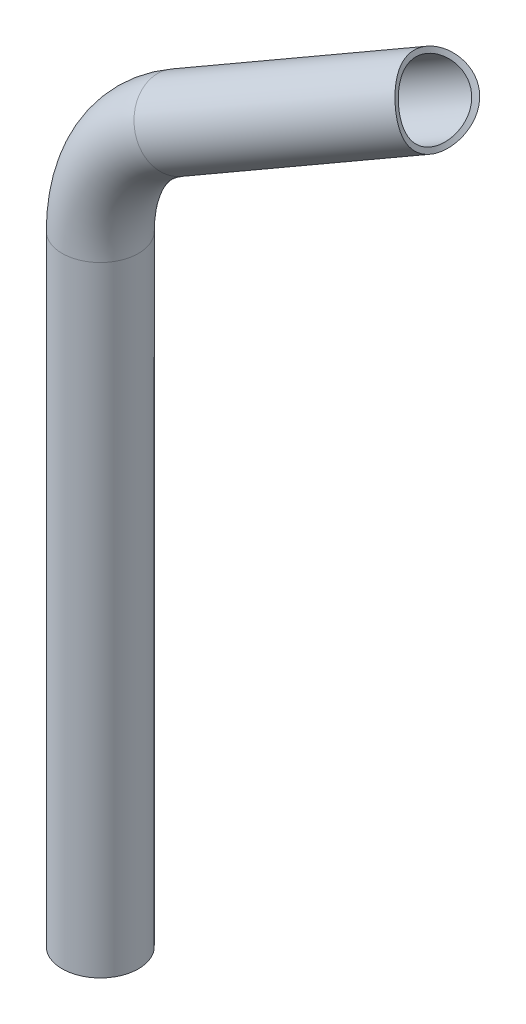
ISO-10303-21;
HEADER;
FILE_DESCRIPTION(('STEP AP214'),'2;1');
FILE_NAME('part.step','',(''),(''),'','','');
FILE_SCHEMA(('AUTOMOTIVE_DESIGN { 1 0 10303 214 1 1 1 1 }'));
ENDSEC;
DATA;
#1=APPLICATION_CONTEXT('core data for automotive mechanical design processes');
#2=APPLICATION_PROTOCOL_DEFINITION('international standard','automotive_design',2000,#1);
#3=PRODUCT_CONTEXT('',#1,'mechanical');
#4=PRODUCT('Part','Part','',(#3));
#5=PRODUCT_RELATED_PRODUCT_CATEGORY('part','',(#4));
#6=PRODUCT_DEFINITION_FORMATION('','',#4);
#7=PRODUCT_DEFINITION_CONTEXT('part definition',#1,'design');
#8=PRODUCT_DEFINITION('design','',#6,#7);
#9=PRODUCT_DEFINITION_SHAPE('','',#8);
#10=(LENGTH_UNIT() NAMED_UNIT(*) SI_UNIT(.MILLI.,.METRE.));
#11=(NAMED_UNIT(*) PLANE_ANGLE_UNIT() SI_UNIT($,.RADIAN.));
#12=(NAMED_UNIT(*) SI_UNIT($,.STERADIAN.) SOLID_ANGLE_UNIT());
#13=UNCERTAINTY_MEASURE_WITH_UNIT(LENGTH_MEASURE(1.E-05),#10,'distance_accuracy_value','');
#14=(GEOMETRIC_REPRESENTATION_CONTEXT(3) GLOBAL_UNCERTAINTY_ASSIGNED_CONTEXT((#13)) GLOBAL_UNIT_ASSIGNED_CONTEXT((#10,
#11,#12)) REPRESENTATION_CONTEXT('',''));
#15=CARTESIAN_POINT('',(0.,0.,0.));
#16=DIRECTION('',(0.,0.,1.));
#17=DIRECTION('',(1.,0.,0.));
#18=AXIS2_PLACEMENT_3D('',#15,#16,#17);
#19=CARTESIAN_POINT('',(-125.,-72.1687836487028,0.));
#20=DIRECTION('',(0.86602540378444,0.499999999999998,0.));
#21=DIRECTION('',(-0.499999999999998,0.86602540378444,0.));
#22=AXIS2_PLACEMENT_3D('',#19,#20,#21);
#23=CYLINDRICAL_SURFACE('',#22,15.);
#24=CARTESIAN_POINT('',(-32.1343184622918,-1.23224933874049,0.));
#25=CARTESIAN_POINT('',(-32.1747169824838,-1.25557177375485,-0.391519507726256));
#26=CARTESIAN_POINT('',(-32.2030378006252,-1.2896340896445,-0.783623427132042));
#27=CARTESIAN_POINT('',(-32.2345045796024,-1.37884393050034,-1.56657088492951));
#28=CARTESIAN_POINT('',(-32.2376441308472,-1.43399682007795,-1.95741407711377));
#29=CARTESIAN_POINT('',(-32.218062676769,-1.56494458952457,-2.73534371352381));
#30=CARTESIAN_POINT('',(-32.1953182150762,-1.64075814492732,-3.12242642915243));
#31=CARTESIAN_POINT('',(-32.1237109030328,-1.81238845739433,-3.88965809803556));
#32=CARTESIAN_POINT('',(-32.0748498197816,-1.90820386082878,-4.26980751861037));
#33=CARTESIAN_POINT('',(-31.9512495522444,-2.11911780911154,-5.02040304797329));
#34=CARTESIAN_POINT('',(-31.8765117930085,-2.23421529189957,-5.39084968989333));
#35=CARTESIAN_POINT('',(-31.7018506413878,-2.48289195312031,-6.11939821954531));
#36=CARTESIAN_POINT('',(-31.6019268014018,-2.61647145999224,-6.47749988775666));
#37=CARTESIAN_POINT('',(-31.378034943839,-2.90122245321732,-7.17881067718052));
#38=CARTESIAN_POINT('',(-31.2540702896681,-3.05239147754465,-7.5220218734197));
#39=CARTESIAN_POINT('',(-30.9835923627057,-3.37144622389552,-8.19134972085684));
#40=CARTESIAN_POINT('',(-30.8370789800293,-3.53933202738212,-8.51746628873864));
#41=CARTESIAN_POINT('',(-30.5231303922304,-3.89116492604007,-9.15100440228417));
#42=CARTESIAN_POINT('',(-30.3556694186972,-4.07513171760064,-9.45840221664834));
#43=CARTESIAN_POINT('',(-30.0020487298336,-4.45812483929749,-10.0523300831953));
#44=CARTESIAN_POINT('',(-29.8158890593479,-4.65715113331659,-10.3388601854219));
#45=CARTESIAN_POINT('',(-29.4270899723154,-5.06957795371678,-10.8896406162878));
#46=CARTESIAN_POINT('',(-29.2244466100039,-5.28298191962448,-11.153885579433));
#47=CARTESIAN_POINT('',(-28.8051164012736,-5.72350044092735,-11.658765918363));
#48=CARTESIAN_POINT('',(-28.5884285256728,-5.95061600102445,-11.8993995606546));
#49=CARTESIAN_POINT('',(-28.1291141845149,-6.43317335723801,-12.3707326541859));
#50=CARTESIAN_POINT('',(-27.8857167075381,-6.6894970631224,-12.5997793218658));
#51=CARTESIAN_POINT('',(-27.3890053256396,-7.21658481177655,-13.0286528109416));
#52=CARTESIAN_POINT('',(-27.1356910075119,-7.48734945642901,-13.2284784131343));
#53=CARTESIAN_POINT('',(-26.6223345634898,-8.04299659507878,-13.5978680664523));
#54=CARTESIAN_POINT('',(-26.3622902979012,-8.32788360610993,-13.7674223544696));
#55=CARTESIAN_POINT('',(-25.8388364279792,-8.91145409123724,-14.0752052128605));
#56=CARTESIAN_POINT('',(-25.575425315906,-9.21014391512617,-14.2134191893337));
#57=CARTESIAN_POINT('',(-25.038186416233,-9.83321546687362,-14.4623556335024));
#58=CARTESIAN_POINT('',(-24.7643707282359,-10.1581480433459,-14.5717312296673));
#59=CARTESIAN_POINT('',(-24.2213917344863,-10.8215410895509,-14.7541586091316));
#60=CARTESIAN_POINT('',(-23.9522260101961,-11.1599942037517,-14.8272298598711));
#61=CARTESIAN_POINT('',(-23.4228491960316,-11.8494041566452,-14.936107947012));
#62=CARTESIAN_POINT('',(-23.1626332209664,-12.2003539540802,-14.9719354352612));
#63=CARTESIAN_POINT('',(-22.655349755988,-12.9134063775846,-15.0056358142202));
#64=CARTESIAN_POINT('',(-22.4082806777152,-13.2755076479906,-15.0035133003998));
#65=CARTESIAN_POINT('',(-21.9499504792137,-13.9802481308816,-14.9626400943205));
#66=CARTESIAN_POINT('',(-21.7373986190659,-14.3222147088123,-14.9267469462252));
#67=CARTESIAN_POINT('',(-21.3298981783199,-15.0116620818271,-14.8225604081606));
#68=CARTESIAN_POINT('',(-21.1349485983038,-15.3591425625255,-14.754268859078));
#69=CARTESIAN_POINT('',(-20.7651013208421,-16.056884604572,-14.5859644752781));
#70=CARTESIAN_POINT('',(-20.5901953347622,-16.407144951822,-14.4859648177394));
#71=CARTESIAN_POINT('',(-20.2620080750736,-17.1077037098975,-14.2553630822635));
#72=CARTESIAN_POINT('',(-20.1087259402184,-17.4580021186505,-14.1247622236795));
#73=CARTESIAN_POINT('',(-19.8370224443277,-18.1252259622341,-13.8471571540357));
#74=CARTESIAN_POINT('',(-19.7167277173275,-18.4424011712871,-13.7025717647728));
#75=CARTESIAN_POINT('',(-19.4949513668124,-19.0720200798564,-13.3905742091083));
#76=CARTESIAN_POINT('',(-19.3934684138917,-19.3844641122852,-13.2231636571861));
#77=CARTESIAN_POINT('',(-19.2089048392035,-20.002536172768,-12.8669650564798));
#78=CARTESIAN_POINT('',(-19.125825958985,-20.3081635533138,-12.6781749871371));
#79=CARTESIAN_POINT('',(-18.9772727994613,-20.9107268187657,-12.2806327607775));
#80=CARTESIAN_POINT('',(-18.9118053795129,-21.207659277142,-12.0718728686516));
#81=CARTESIAN_POINT('',(-18.7935729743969,-21.8107874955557,-11.6210174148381));
#82=CARTESIAN_POINT('',(-18.7419756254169,-22.1162384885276,-11.3776200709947));
#83=CARTESIAN_POINT('',(-18.6562040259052,-22.7131952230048,-10.8712224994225));
#84=CARTESIAN_POINT('',(-18.6220372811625,-23.0046949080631,-10.6082138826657));
#85=CARTESIAN_POINT('',(-18.569552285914,-23.5718746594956,-10.0640396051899));
#86=CARTESIAN_POINT('',(-18.5512385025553,-23.8475502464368,-9.78286885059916));
#87=CARTESIAN_POINT('',(-18.528854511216,-24.3812746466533,-9.203721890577));
#88=CARTESIAN_POINT('',(-18.5247854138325,-24.6393220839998,-8.90574437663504));
#89=CARTESIAN_POINT('',(-18.5296296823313,-25.1718783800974,-8.25011028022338));
#90=CARTESIAN_POINT('',(-18.540497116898,-25.4434059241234,-7.89003917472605));
#91=CARTESIAN_POINT('',(-18.5765153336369,-25.9586375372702,-7.15109605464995));
#92=CARTESIAN_POINT('',(-18.6016689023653,-26.2023361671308,-6.77222038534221));
#93=CARTESIAN_POINT('',(-18.6641159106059,-26.6593774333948,-5.99715626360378));
#94=CARTESIAN_POINT('',(-18.7014177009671,-26.8726990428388,-5.60095606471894));
#95=CARTESIAN_POINT('',(-18.7860797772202,-27.2659373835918,-4.79353883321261));
#96=CARTESIAN_POINT('',(-18.8334355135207,-27.4458691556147,-4.38232866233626));
#97=CARTESIAN_POINT('',(-18.9376562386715,-27.7740038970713,-3.53553653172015));
#98=CARTESIAN_POINT('',(-18.9947440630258,-27.9212153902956,-3.09959611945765));
#99=CARTESIAN_POINT('',(-19.1154615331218,-28.1744729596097,-2.21672333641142));
#100=CARTESIAN_POINT('',(-19.1790914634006,-28.2805172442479,-1.76979048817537));
#101=CARTESIAN_POINT('',(-19.310891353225,-28.448451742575,-0.868821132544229));
#102=CARTESIAN_POINT('',(-19.3790563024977,-28.5103898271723,-0.414792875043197));
#103=CARTESIAN_POINT('',(-19.5181695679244,-28.587820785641,0.496781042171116));
#104=CARTESIAN_POINT('',(-19.5891173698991,-28.6033221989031,0.95432603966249));
#105=CARTESIAN_POINT('',(-19.7233391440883,-28.5872193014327,1.81205040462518));
#106=CARTESIAN_POINT('',(-19.7864829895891,-28.5611772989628,2.21235994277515));
#107=CARTESIAN_POINT('',(-19.9126714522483,-28.47150098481,3.00876364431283));
#108=CARTESIAN_POINT('',(-19.9757160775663,-28.4078699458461,3.40485817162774));
#109=CARTESIAN_POINT('',(-20.1008740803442,-28.2431698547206,4.18913223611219));
#110=CARTESIAN_POINT('',(-20.1629878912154,-28.1421188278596,4.5773154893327));
#111=CARTESIAN_POINT('',(-20.2857242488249,-27.9034113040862,5.34248921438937));
#112=CARTESIAN_POINT('',(-20.3463468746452,-27.765756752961,5.71948028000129));
#113=CARTESIAN_POINT('',(-20.4598294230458,-27.4707809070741,6.42232810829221));
#114=CARTESIAN_POINT('',(-20.5128631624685,-27.3167616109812,6.74954934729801));
#115=CARTESIAN_POINT('',(-20.6173601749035,-26.9818040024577,7.39013066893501));
#116=CARTESIAN_POINT('',(-20.6688235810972,-26.8008679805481,7.70349192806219));
#117=CARTESIAN_POINT('',(-20.7702736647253,-26.4138728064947,8.31455338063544));
#118=CARTESIAN_POINT('',(-20.8202602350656,-26.2078118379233,8.61225243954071));
#119=CARTESIAN_POINT('',(-20.9190015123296,-25.7725791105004,9.19045757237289));
#120=CARTESIAN_POINT('',(-20.9677561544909,-25.5434061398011,9.47096274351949));
#121=CARTESIAN_POINT('',(-21.0662867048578,-25.0548100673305,10.0240219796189));
#122=CARTESIAN_POINT('',(-21.116029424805,-24.7945609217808,10.2958515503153));
#123=CARTESIAN_POINT('',(-21.2152001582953,-24.253711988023,10.8186627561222));
#124=CARTESIAN_POINT('',(-21.2646280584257,-23.9731052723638,11.0696372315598));
#125=CARTESIAN_POINT('',(-21.3638698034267,-23.3939129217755,11.5498752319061));
#126=CARTESIAN_POINT('',(-21.4136837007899,-23.0953248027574,11.7791357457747));
#127=CARTESIAN_POINT('',(-21.5145114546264,-22.4824518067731,12.2153013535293));
#128=CARTESIAN_POINT('',(-21.565525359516,-22.1681662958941,12.4222055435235));
#129=CARTESIAN_POINT('',(-21.676378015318,-21.4846657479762,12.8383601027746));
#130=CARTESIAN_POINT('',(-21.7365071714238,-21.1135892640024,13.0444809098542));
#131=CARTESIAN_POINT('',(-21.860886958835,-20.3571827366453,13.4269616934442));
#132=CARTESIAN_POINT('',(-21.9251368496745,-19.9718552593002,13.6033269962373));
#133=CARTESIAN_POINT('',(-22.0593938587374,-19.1892776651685,13.9259204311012));
#134=CARTESIAN_POINT('',(-22.129406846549,-18.7920156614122,14.0721172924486));
#135=CARTESIAN_POINT('',(-22.2767765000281,-17.9887275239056,14.333483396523));
#136=CARTESIAN_POINT('',(-22.3541334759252,-17.5827010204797,14.4486513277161));
#137=CARTESIAN_POINT('',(-22.5254464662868,-16.7269312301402,14.6563591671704));
#138=CARTESIAN_POINT('',(-22.6202755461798,-16.2766119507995,14.7458293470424));
#139=CARTESIAN_POINT('',(-22.8228840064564,-15.3728400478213,14.8856731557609));
#140=CARTESIAN_POINT('',(-22.9306620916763,-14.919387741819,14.9360506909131));
#141=CARTESIAN_POINT('',(-23.1611062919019,-14.0138580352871,14.99646860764));
#142=CARTESIAN_POINT('',(-23.2837620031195,-13.5617798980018,15.0065370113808));
#143=CARTESIAN_POINT('',(-23.5456292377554,-12.6634189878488,14.9852248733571));
#144=CARTESIAN_POINT('',(-23.684838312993,-12.2171353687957,14.9538504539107));
#145=CARTESIAN_POINT('',(-23.9693765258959,-11.3693824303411,14.8528144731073));
#146=CARTESIAN_POINT('',(-24.1134113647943,-10.9671064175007,14.7862834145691));
#147=CARTESIAN_POINT('',(-24.4164423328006,-10.1760402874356,14.6168597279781));
#148=CARTESIAN_POINT('',(-24.575437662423,-9.78724945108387,14.5139690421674));
#149=CARTESIAN_POINT('',(-24.9074597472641,-9.0276635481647,14.27220584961));
#150=CARTESIAN_POINT('',(-25.0804741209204,-8.65685305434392,14.1333648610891));
#151=CARTESIAN_POINT('',(-25.4389914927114,-7.93671517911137,13.8205893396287));
#152=CARTESIAN_POINT('',(-25.6244931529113,-7.58738550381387,13.6466585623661));
#153=CARTESIAN_POINT('',(-25.9797969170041,-6.95888904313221,13.2910327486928));
#154=CARTESIAN_POINT('',(-26.1483421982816,-6.67661363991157,13.1135486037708));
#155=CARTESIAN_POINT('',(-26.4909734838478,-6.13207097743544,12.7348192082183));
#156=CARTESIAN_POINT('',(-26.6650595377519,-5.86980389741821,12.5335737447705));
#157=CARTESIAN_POINT('',(-27.0165875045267,-5.36637197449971,12.1088199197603));
#158=CARTESIAN_POINT('',(-27.194029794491,-5.12520952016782,11.8853090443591));
#159=CARTESIAN_POINT('',(-27.5499452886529,-4.66465369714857,11.4176402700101));
#160=CARTESIAN_POINT('',(-27.72841854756,-4.44526149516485,11.1734812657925));
#161=CARTESIAN_POINT('',(-28.0876939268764,-4.02425849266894,10.6609407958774));
#162=CARTESIAN_POINT('',(-28.2684687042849,-3.82310484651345,10.3921651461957));
#163=CARTESIAN_POINT('',(-28.6262420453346,-3.44370745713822,9.83641245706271));
#164=CARTESIAN_POINT('',(-28.8032394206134,-3.26547083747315,9.54942979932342));
#165=CARTESIAN_POINT('',(-29.1511156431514,-2.93168432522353,8.95879816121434));
#166=CARTESIAN_POINT('',(-29.3219912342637,-2.77614637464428,8.65514052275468));
#167=CARTESIAN_POINT('',(-29.6552449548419,-2.48754713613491,8.03284401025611));
#168=CARTESIAN_POINT('',(-29.8176225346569,-2.35448730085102,7.71420416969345));
#169=CARTESIAN_POINT('',(-30.1491980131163,-2.09688701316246,7.02716887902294));
#170=CARTESIAN_POINT('',(-30.3171383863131,-1.97494975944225,6.65718656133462));
#171=CARTESIAN_POINT('',(-30.6368797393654,-1.75796401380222,5.90278844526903));
#172=CARTESIAN_POINT('',(-30.7886850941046,-1.6629082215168,5.51837659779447));
#173=CARTESIAN_POINT('',(-31.0733245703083,-1.49929109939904,4.73760730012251));
#174=CARTESIAN_POINT('',(-31.2061806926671,-1.4306988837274,4.34126436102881));
#175=CARTESIAN_POINT('',(-31.450530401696,-1.31948435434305,3.53863319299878));
#176=CARTESIAN_POINT('',(-31.562031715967,-1.27685263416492,3.13234862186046));
#177=CARTESIAN_POINT('',(-31.7703401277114,-1.214480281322,2.27526203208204));
#178=CARTESIAN_POINT('',(-31.8649265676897,-1.19714078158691,1.82374025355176));
#179=CARTESIAN_POINT('',(-32.023291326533,-1.19238427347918,0.915079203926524));
#180=CARTESIAN_POINT('',(-32.0870664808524,-1.20497033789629,0.457939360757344));
#181=CARTESIAN_POINT('',(-32.1343184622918,-1.23224933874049,0.));
#182=B_SPLINE_CURVE_WITH_KNOTS('',3,(#24,#25,#26,#27,#28,#29,#30,#31,#32,#33,#34,#35,#36,#37,
#38,#39,#40,#41,#42,#43,#44,#45,#46,#47,#48,#49,#50,#51,#52,#53,#54,#55,#56,#57,#58,#59,#60,#61,
#62,#63,#64,#65,#66,#67,#68,#69,#70,#71,#72,#73,#74,#75,#76,#77,#78,#79,#80,#81,#82,#83,#84,#85,
#86,#87,#88,#89,#90,#91,#92,#93,#94,#95,#96,#97,#98,#99,#100,#101,#102,#103,#104,#105,#106,#107,
#108,#109,#110,#111,#112,#113,#114,#115,#116,#117,#118,#119,#120,#121,#122,#123,#124,#125,#126,
#127,#128,#129,#130,#131,#132,#133,#134,#135,#136,#137,#138,#139,#140,#141,#142,#143,#144,#145,
#146,#147,#148,#149,#150,#151,#152,#153,#154,#155,#156,#157,#158,#159,#160,#161,#162,#163,#164,
#165,#166,#167,#168,#169,#170,#171,#172,#173,#174,#175,#176,#177,#178,#179,#180,#181),
.UNSPECIFIED.,.T.,.F.,(4,2,2,2,2,2,2,2,2,2,2,2,2,2,2,2,2,2,2,2,2,2,2,2,2,2,2,2,2,2,2,2,2,2,2,2,
2,2,2,2,2,2,2,2,2,2,2,2,2,2,2,2,2,2,2,2,2,2,2,2,2,2,2,2,2,2,2,2,2,2,2,2,2,2,2,2,2,2,4),(0.,
1.18248421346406,2.36526940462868,3.54912730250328,4.73290510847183,5.91661773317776,
7.10035139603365,8.28391956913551,9.46749351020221,10.6525379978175,11.8375796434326,
13.02290579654,14.2083189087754,15.4705069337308,16.7327476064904,17.9953946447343,
19.258628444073,20.5732438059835,21.8871534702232,23.2003341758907,24.5133558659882,
25.7244012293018,26.935377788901,28.1458517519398,29.3562774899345,30.461296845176,
31.5662380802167,32.6712838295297,33.7767593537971,34.9574660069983,36.1386806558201,
37.3202280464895,38.5018675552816,39.8536812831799,41.205758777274,42.5587676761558,
43.9111656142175,45.3001966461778,46.6892881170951,48.0768696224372,49.4641959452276,
50.6807905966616,51.8972793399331,53.1131828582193,54.3290217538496,55.4243413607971,
56.5195678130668,57.6148734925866,58.7102366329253,59.8478674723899,60.9858872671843,
62.1240646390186,63.2622880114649,64.5470994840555,65.8316807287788,67.1175868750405,
68.4035473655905,69.8082023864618,71.2127170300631,72.6162551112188,74.0195858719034,
75.3149781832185,76.6103013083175,77.9044926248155,79.198545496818,80.3180708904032,
81.4376063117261,82.5572682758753,83.6769902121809,84.8196846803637,85.9627334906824,
87.1063815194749,88.2501034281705,89.5213220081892,90.7921950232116,92.0615802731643,
93.3305053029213,94.7134516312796,96.0965399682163),.UNSPECIFIED.);
#183=CARTESIAN_POINT('',(-32.1343184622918,-1.23224933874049,0.));
#184=VERTEX_POINT('',#183);
#185=EDGE_CURVE('E53',#184,#184,#182,.T.);
#186=ORIENTED_EDGE('',*,*,#185,.T.);
#187=EDGE_LOOP('',(#186));
#188=FACE_BOUND('',#187,.T.);
#189=CARTESIAN_POINT('',(-125.,-72.1687836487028,0.));
#190=DIRECTION('',(-0.86602540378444,-0.499999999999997,0.));
#191=DIRECTION('',(0.,0.,-1.));
#192=AXIS2_PLACEMENT_3D('',#189,#190,#191);
#193=CIRCLE('',#192,15.);
#194=CARTESIAN_POINT('',(-132.5,-59.1784025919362,0.));
#195=VERTEX_POINT('',#194);
#196=EDGE_CURVE('E10',#195,#195,#193,.T.);
#197=ORIENTED_EDGE('',*,*,#196,.F.);
#198=EDGE_LOOP('',(#197));
#199=FACE_BOUND('',#198,.T.);
#200=ADVANCED_FACE('F28',(#188,#199),#23,.T.);
#201=CARTESIAN_POINT('',(-125.,-72.1687836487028,0.));
#202=DIRECTION('',(0.86602540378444,0.499999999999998,0.));
#203=DIRECTION('',(-0.499999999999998,0.86602540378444,0.));
#204=AXIS2_PLACEMENT_3D('',#201,#202,#203);
#205=CYLINDRICAL_SURFACE('',#204,13.);
#206=CARTESIAN_POINT('',(-31.3644885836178,-3.09718892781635,0.));
#207=CARTESIAN_POINT('',(-31.3942172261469,-3.11435488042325,-0.346471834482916));
#208=CARTESIAN_POINT('',(-31.4137407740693,-3.1416320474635,-0.693378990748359));
#209=CARTESIAN_POINT('',(-31.43155897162,-3.2160484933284,-1.385741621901));
#210=CARTESIAN_POINT('',(-31.4298440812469,-3.2631966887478,-1.73119637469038));
#211=CARTESIAN_POINT('',(-31.4046668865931,-3.3769942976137,-2.41867904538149));
#212=CARTESIAN_POINT('',(-31.381168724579,-3.44367574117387,-2.76070037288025));
#213=CARTESIAN_POINT('',(-31.3122522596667,-3.59595070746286,-3.43822168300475));
#214=CARTESIAN_POINT('',(-31.2668365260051,-3.68154201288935,-3.77372242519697));
#215=CARTESIAN_POINT('',(-31.1543632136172,-3.87095830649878,-4.43565792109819));
#216=CARTESIAN_POINT('',(-31.0873157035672,-3.97477480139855,-4.76209681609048));
#217=CARTESIAN_POINT('',(-30.9321923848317,-4.19995806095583,-5.40373819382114));
#218=CARTESIAN_POINT('',(-30.8441159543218,-4.32132534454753,-5.71894034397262));
#219=CARTESIAN_POINT('',(-30.6479429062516,-4.58079413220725,-6.33579081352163));
#220=CARTESIAN_POINT('',(-30.5398533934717,-4.71888969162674,-6.63744389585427));
#221=CARTESIAN_POINT('',(-30.3049175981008,-5.0110561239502,-7.22530306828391));
#222=CARTESIAN_POINT('',(-30.1780713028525,-5.16512700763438,-7.51150914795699));
#223=CARTESIAN_POINT('',(-29.9068972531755,-5.48878189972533,-8.06723022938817));
#224=CARTESIAN_POINT('',(-29.7625346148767,-5.65839669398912,-8.33671025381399));
#225=CARTESIAN_POINT('',(-29.4583106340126,-6.01210758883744,-8.8567384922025));
#226=CARTESIAN_POINT('',(-29.2984492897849,-6.19620369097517,-9.10728670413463));
#227=CARTESIAN_POINT('',(-28.9651550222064,-6.57818721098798,-9.58807300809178));
#228=CARTESIAN_POINT('',(-28.7917202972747,-6.77607645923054,-9.81830839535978));
#229=CARTESIAN_POINT('',(-28.433322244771,-7.18503692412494,-10.2572668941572));
#230=CARTESIAN_POINT('',(-28.248354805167,-7.3961128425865,-10.4659822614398));
#231=CARTESIAN_POINT('',(-27.859992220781,-7.84127038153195,-10.8702263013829));
#232=CARTESIAN_POINT('',(-27.6561385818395,-8.07597050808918,-11.0646343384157));
#233=CARTESIAN_POINT('',(-27.2408657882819,-8.55849218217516,-11.4273570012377));
#234=CARTESIAN_POINT('',(-27.0294462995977,-8.80631430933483,-11.5956704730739));
#235=CARTESIAN_POINT('',(-26.6016869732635,-9.31456642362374,-11.9052166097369));
#236=CARTESIAN_POINT('',(-26.3853449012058,-9.57500219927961,-12.0464366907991));
#237=CARTESIAN_POINT('',(-25.9507588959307,-10.1076080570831,-12.3006701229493));
#238=CARTESIAN_POINT('',(-25.7325157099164,-10.3797736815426,-12.4136940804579));
#239=CARTESIAN_POINT('',(-25.2924915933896,-10.9408743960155,-12.6127278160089));
#240=CARTESIAN_POINT('',(-25.0707300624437,-11.2300390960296,-12.6981350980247));
#241=CARTESIAN_POINT('',(-24.6313567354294,-11.818878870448,-12.8378585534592));
#242=CARTESIAN_POINT('',(-24.4137450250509,-12.1185541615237,-12.892174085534));
#243=CARTESIAN_POINT('',(-23.9859917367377,-12.7269219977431,-12.9690172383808));
#244=CARTESIAN_POINT('',(-23.7758457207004,-13.0356089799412,-12.9915640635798));
#245=CARTESIAN_POINT('',(-23.3659941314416,-13.6604969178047,-13.0045168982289));
#246=CARTESIAN_POINT('',(-23.1662876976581,-13.9766972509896,-12.9949255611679));
#247=CARTESIAN_POINT('',(-22.7924977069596,-14.5942102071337,-12.9451937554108));
#248=CARTESIAN_POINT('',(-22.6175923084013,-14.895186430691,-12.9070403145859));
#249=CARTESIAN_POINT('',(-22.2814951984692,-15.4999462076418,-12.8028151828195));
#250=CARTESIAN_POINT('',(-22.1203028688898,-15.8037296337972,-12.7367447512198));
#251=CARTESIAN_POINT('',(-21.8133162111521,-16.4118291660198,-12.5773476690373));
#252=CARTESIAN_POINT('',(-21.6675184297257,-16.7161451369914,-12.4840271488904));
#253=CARTESIAN_POINT('',(-21.3924433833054,-17.3230314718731,-12.2711017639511));
#254=CARTESIAN_POINT('',(-21.2631658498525,-17.625601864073,-12.1514973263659));
#255=CARTESIAN_POINT('',(-21.0280889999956,-18.2108765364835,-11.8941818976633));
#256=CARTESIAN_POINT('',(-20.9214152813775,-18.4937920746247,-11.7577453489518));
#257=CARTESIAN_POINT('',(-20.7236017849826,-19.053924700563,-11.4636327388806));
#258=CARTESIAN_POINT('',(-20.6324613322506,-19.3311420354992,-11.3059576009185));
#259=CARTESIAN_POINT('',(-20.4654716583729,-19.8780152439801,-10.9706684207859));
#260=CARTESIAN_POINT('',(-20.3896230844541,-20.1476707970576,-10.7930535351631));
#261=CARTESIAN_POINT('',(-20.2526651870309,-20.677750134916,-10.4191497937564));
#262=CARTESIAN_POINT('',(-20.1915615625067,-20.9381703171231,-10.2228537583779));
#263=CARTESIAN_POINT('',(-20.0799957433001,-21.4640037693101,-9.80010552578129));
#264=CARTESIAN_POINT('',(-20.0304386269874,-21.7287098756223,-9.57253495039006));
#265=CARTESIAN_POINT('',(-19.9460673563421,-22.2440218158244,-9.09921682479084));
#266=CARTESIAN_POINT('',(-19.9112597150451,-22.4946213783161,-8.85346130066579));
#267=CARTESIAN_POINT('',(-19.855221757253,-22.9799474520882,-8.34517951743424));
#268=CARTESIAN_POINT('',(-19.8339950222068,-23.2146697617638,-8.08264885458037));
#269=CARTESIAN_POINT('',(-19.8038982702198,-23.6665185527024,-7.54218238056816));
#270=CARTESIAN_POINT('',(-19.7950289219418,-23.8836440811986,-7.2642457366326));
#271=CARTESIAN_POINT('',(-19.78806565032,-24.3202770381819,-6.66454219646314));
#272=CARTESIAN_POINT('',(-19.791189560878,-24.5376794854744,-6.34122451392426));
#273=CARTESIAN_POINT('',(-19.8093586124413,-24.9468565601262,-5.6790010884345));
#274=CARTESIAN_POINT('',(-19.8244058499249,-25.138626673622,-5.34009261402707));
#275=CARTESIAN_POINT('',(-19.8648463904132,-25.4943346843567,-4.64836833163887));
#276=CARTESIAN_POINT('',(-19.8902438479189,-25.658261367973,-4.29554699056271));
#277=CARTESIAN_POINT('',(-19.9498432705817,-25.9558525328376,-3.57825039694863));
#278=CARTESIAN_POINT('',(-19.9840411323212,-26.0895310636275,-3.21378064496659));
#279=CARTESIAN_POINT('',(-20.0598657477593,-26.3247471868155,-2.47443897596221));
#280=CARTESIAN_POINT('',(-20.1015086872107,-26.4262133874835,-2.09954592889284));
#281=CARTESIAN_POINT('',(-20.1907632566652,-26.5944724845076,-1.34270920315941));
#282=CARTESIAN_POINT('',(-20.2383749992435,-26.6612647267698,-0.960765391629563));
#283=CARTESIAN_POINT('',(-20.338187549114,-26.7582564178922,-0.193152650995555));
#284=CARTESIAN_POINT('',(-20.3903844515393,-26.7884866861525,0.19251286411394));
#285=CARTESIAN_POINT('',(-20.4981585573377,-26.8109987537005,0.964475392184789));
#286=CARTESIAN_POINT('',(-20.5537353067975,-26.8032856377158,1.35077231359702));
#287=CARTESIAN_POINT('',(-20.6611913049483,-26.7519306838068,2.07980256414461));
#288=CARTESIAN_POINT('',(-20.7128447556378,-26.7121525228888,2.42284501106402));
#289=CARTESIAN_POINT('',(-20.817290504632,-26.6014370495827,3.10368338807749));
#290=CARTESIAN_POINT('',(-20.8700827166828,-26.5305020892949,3.44147971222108));
#291=CARTESIAN_POINT('',(-20.9762423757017,-26.3579033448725,4.10891651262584));
#292=CARTESIAN_POINT('',(-21.0296096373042,-26.2562491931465,4.43855951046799));
#293=CARTESIAN_POINT('',(-21.1365449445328,-26.0231264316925,5.08708684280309));
#294=CARTESIAN_POINT('',(-21.1901129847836,-25.8916586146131,5.40597146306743));
#295=CARTESIAN_POINT('',(-21.293513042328,-25.6104271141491,6.00879474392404));
#296=CARTESIAN_POINT('',(-21.3433465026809,-25.4625647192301,6.29362320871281));
#297=CARTESIAN_POINT('',(-21.4429594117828,-25.1436763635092,6.84998154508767));
#298=CARTESIAN_POINT('',(-21.4927388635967,-24.9726517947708,7.12151221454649));
#299=CARTESIAN_POINT('',(-21.5923425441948,-24.6090668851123,7.64975496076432));
#300=CARTESIAN_POINT('',(-21.6421667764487,-24.4165047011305,7.9064657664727));
#301=CARTESIAN_POINT('',(-21.7420748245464,-24.0116375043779,8.40375590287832));
#302=CARTESIAN_POINT('',(-21.7921586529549,-23.7993315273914,8.64433444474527));
#303=CARTESIAN_POINT('',(-21.8952171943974,-23.3467189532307,9.1188976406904));
#304=CARTESIAN_POINT('',(-21.9482194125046,-23.1055760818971,9.35207835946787));
#305=CARTESIAN_POINT('',(-22.0553759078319,-22.6057891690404,9.79873101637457));
#306=CARTESIAN_POINT('',(-22.1095305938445,-22.3471388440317,10.0121958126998));
#307=CARTESIAN_POINT('',(-22.2195827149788,-21.8144542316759,10.4185987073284));
#308=CARTESIAN_POINT('',(-22.2754805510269,-21.5404163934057,10.6115320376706));
#309=CARTESIAN_POINT('',(-22.3896844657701,-20.9790769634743,10.9761709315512));
#310=CARTESIAN_POINT('',(-22.4479904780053,-20.6917757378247,11.147877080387));
#311=CARTESIAN_POINT('',(-22.5742456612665,-20.0741685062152,11.4869330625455));
#312=CARTESIAN_POINT('',(-22.6425557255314,-19.7425722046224,11.6518028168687));
#313=CARTESIAN_POINT('',(-22.7841531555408,-19.0681289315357,11.9541321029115));
#314=CARTESIAN_POINT('',(-22.8574408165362,-18.7252812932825,12.0915900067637));
#315=CARTESIAN_POINT('',(-23.0101735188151,-18.0307554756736,12.3384772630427));
#316=CARTESIAN_POINT('',(-23.0896217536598,-17.6790727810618,12.4478919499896));
#317=CARTESIAN_POINT('',(-23.2557991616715,-16.9696342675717,12.6379033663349));
#318=CARTESIAN_POINT('',(-23.3425293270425,-16.6118776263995,12.7184961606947));
#319=CARTESIAN_POINT('',(-23.5293099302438,-15.8734913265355,12.8536834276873));
#320=CARTESIAN_POINT('',(-23.6298281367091,-15.4926753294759,12.9066267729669));
#321=CARTESIAN_POINT('',(-23.8412671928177,-14.7308896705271,12.9787382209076));
#322=CARTESIAN_POINT('',(-23.952183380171,-14.3499201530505,12.9979213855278));
#323=CARTESIAN_POINT('',(-24.1852684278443,-13.5914242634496,13.0017576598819));
#324=CARTESIAN_POINT('',(-24.3074319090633,-13.213896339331,12.9864271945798));
#325=CARTESIAN_POINT('',(-24.5635021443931,-12.4659446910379,12.9206619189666));
#326=CARTESIAN_POINT('',(-24.6974074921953,-12.095520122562,12.8702313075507));
#327=CARTESIAN_POINT('',(-24.966033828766,-11.393981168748,12.7392954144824));
#328=CARTESIAN_POINT('',(-25.0998892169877,-11.0620435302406,12.6614205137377));
#329=CARTESIAN_POINT('',(-25.3769277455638,-10.4106555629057,12.4757455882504));
#330=CARTESIAN_POINT('',(-25.5201104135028,-10.0912046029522,12.3679470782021));
#331=CARTESIAN_POINT('',(-25.8146527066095,-9.46785721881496,12.1230542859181));
#332=CARTESIAN_POINT('',(-25.9660087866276,-9.16395416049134,11.9859726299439));
#333=CARTESIAN_POINT('',(-26.2753776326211,-8.57417747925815,11.6834903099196));
#334=CARTESIAN_POINT('',(-26.4333900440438,-8.28830289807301,11.5180911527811));
#335=CARTESIAN_POINT('',(-26.739697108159,-7.7614853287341,11.1764149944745));
#336=CARTESIAN_POINT('',(-26.88759378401,-7.5188115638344,11.0024408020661));
#337=CARTESIAN_POINT('',(-27.1855249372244,-7.05147526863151,10.6334558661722));
#338=CARTESIAN_POINT('',(-27.335559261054,-6.82681145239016,10.438446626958));
#339=CARTESIAN_POINT('',(-27.6359259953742,-6.39639298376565,10.0287774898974));
#340=CARTESIAN_POINT('',(-27.7862584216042,-6.19063935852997,9.81411652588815));
#341=CARTESIAN_POINT('',(-28.0852999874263,-5.7986425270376,9.36662221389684));
#342=CARTESIAN_POINT('',(-28.2340090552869,-5.61240017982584,9.13378806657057));
#343=CARTESIAN_POINT('',(-28.5321252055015,-5.25465744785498,8.64446761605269));
#344=CARTESIAN_POINT('',(-28.6814278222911,-5.083740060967,8.3874916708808));
#345=CARTESIAN_POINT('',(-28.9742393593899,-4.76300726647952,7.85744013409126));
#346=CARTESIAN_POINT('',(-29.1177462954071,-4.61319904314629,7.58435910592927));
#347=CARTESIAN_POINT('',(-29.3969874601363,-4.33464132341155,7.02360478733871));
#348=CARTESIAN_POINT('',(-29.5327166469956,-4.20590538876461,6.73592225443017));
#349=CARTESIAN_POINT('',(-29.7943594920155,-3.96948845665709,6.14772120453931));
#350=CARTESIAN_POINT('',(-29.9202726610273,-3.86180850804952,5.84720204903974));
#351=CARTESIAN_POINT('',(-30.1697028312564,-3.65981973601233,5.21126018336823));
#352=CARTESIAN_POINT('',(-30.2922822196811,-3.56718794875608,4.8749351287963));
#353=CARTESIAN_POINT('',(-30.5216304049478,-3.4059624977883,4.19143520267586));
#354=CARTESIAN_POINT('',(-30.6284041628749,-3.33736128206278,3.84426377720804));
#355=CARTESIAN_POINT('',(-30.8239472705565,-3.22400757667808,3.1417863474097));
#356=CARTESIAN_POINT('',(-30.9127498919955,-3.17921076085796,2.78649675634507));
#357=CARTESIAN_POINT('',(-31.0706928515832,-3.11302569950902,2.06957911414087));
#358=CARTESIAN_POINT('',(-31.1398438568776,-3.0916247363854,1.70795461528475));
#359=CARTESIAN_POINT('',(-31.2342488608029,-3.07571132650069,1.12143530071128));
#360=CARTESIAN_POINT('',(-31.2661360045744,-3.07400003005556,0.897761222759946));
#361=CARTESIAN_POINT('',(-31.3216112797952,-3.07916896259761,0.449452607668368));
#362=CARTESIAN_POINT('',(-31.3451983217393,-3.08605031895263,0.224817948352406));
#363=CARTESIAN_POINT('',(-31.3644885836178,-3.09718892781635,0.));
#364=B_SPLINE_CURVE_WITH_KNOTS('',3,(#206,#207,#208,#209,#210,#211,#212,#213,#214,#215,#216,
#217,#218,#219,#220,#221,#222,#223,#224,#225,#226,#227,#228,#229,#230,#231,#232,#233,#234,#235,
#236,#237,#238,#239,#240,#241,#242,#243,#244,#245,#246,#247,#248,#249,#250,#251,#252,#253,#254,
#255,#256,#257,#258,#259,#260,#261,#262,#263,#264,#265,#266,#267,#268,#269,#270,#271,#272,#273,
#274,#275,#276,#277,#278,#279,#280,#281,#282,#283,#284,#285,#286,#287,#288,#289,#290,#291,#292,
#293,#294,#295,#296,#297,#298,#299,#300,#301,#302,#303,#304,#305,#306,#307,#308,#309,#310,#311,
#312,#313,#314,#315,#316,#317,#318,#319,#320,#321,#322,#323,#324,#325,#326,#327,#328,#329,#330,
#331,#332,#333,#334,#335,#336,#337,#338,#339,#340,#341,#342,#343,#344,#345,#346,#347,#348,#349,
#350,#351,#352,#353,#354,#355,#356,#357,#358,#359,#360,#361,#362,#363),.UNSPECIFIED.,.T.,.F.,(4,
2,2,2,2,2,2,2,2,2,2,2,2,2,2,2,2,2,2,2,2,2,2,2,2,2,2,2,2,2,2,2,2,2,2,2,2,2,2,2,2,2,2,2,2,2,2,2,2,
2,2,2,2,2,2,2,2,2,2,2,2,2,2,2,2,2,2,2,2,2,2,2,2,2,2,2,2,2,4),(0.,1.04430459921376,
2.08907830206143,3.1355748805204,4.18194881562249,5.22783640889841,6.27375493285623,
7.31930285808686,8.36485148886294,9.41251760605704,10.4601838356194,11.5079893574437,
12.5561706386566,13.6548786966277,14.7536353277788,15.8529010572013,16.9517526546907,
18.0731726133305,19.1946157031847,20.3153805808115,21.4360529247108,22.4852633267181,
23.5344264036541,24.5833536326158,25.6322638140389,26.6263051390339,27.6203032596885,
28.6143434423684,29.6087672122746,30.6654133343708,31.7225255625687,32.7799164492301,
33.8373645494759,35.0048927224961,36.1726262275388,37.340828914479,38.5084878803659,
39.6787169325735,40.8489680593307,42.0182320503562,43.1873393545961,44.2334997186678,
45.2795811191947,46.3253348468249,47.3710607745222,48.3442602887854,49.3174013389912,
50.2906257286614,51.2638976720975,52.2816532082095,53.2997759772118,54.3181346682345,
55.336465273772,56.4649429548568,57.5934876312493,58.722621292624,59.8519090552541,
61.0425753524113,62.2327103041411,63.4222789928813,64.6117054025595,65.7090550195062,
66.8063491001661,67.9031710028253,68.999934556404,69.998419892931,70.9968338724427,
71.9953020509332,72.9938141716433,74.0212382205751,75.0490111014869,76.0774428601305,
77.1059258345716,78.2139115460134,79.3215487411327,80.4271161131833,81.5320822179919,
82.2096195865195,82.887245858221),.UNSPECIFIED.);
#365=CARTESIAN_POINT('',(-31.3644885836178,-3.09718892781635,0.));
#366=VERTEX_POINT('',#365);
#367=EDGE_CURVE('E32',#366,#366,#364,.T.);
#368=ORIENTED_EDGE('',*,*,#367,.F.);
#369=EDGE_LOOP('',(#368));
#370=FACE_BOUND('',#369,.T.);
#371=CARTESIAN_POINT('',(-125.,-72.1687836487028,0.));
#372=DIRECTION('',(-0.86602540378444,-0.499999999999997,0.));
#373=DIRECTION('',(0.,0.,-1.));
#374=AXIS2_PLACEMENT_3D('',#371,#372,#373);
#375=CIRCLE('',#374,13.);
#376=CARTESIAN_POINT('',(-131.5,-60.9104533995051,0.));
#377=VERTEX_POINT('',#376);
#378=EDGE_CURVE('E39',#377,#377,#375,.T.);
#379=ORIENTED_EDGE('',*,*,#378,.T.);
#380=EDGE_LOOP('',(#379));
#381=FACE_BOUND('',#380,.T.);
#382=ADVANCED_FACE('F85',(#370,#381),#205,.F.);
#383=CARTESIAN_POINT('',(-95.,-124.130307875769,0.));
#384=DIRECTION('',(0.,0.,-1.));
#385=DIRECTION('',(-1.,0.,0.));
#386=AXIS2_PLACEMENT_3D('',#383,#384,#385);
#387=TOROIDAL_SURFACE('',#386,60.,15.);
#388=CARTESIAN_POINT('',(-155.,-124.130307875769,0.));
#389=DIRECTION('',(0.,-1.,0.));
#390=DIRECTION('',(0.,0.,-1.));
#391=AXIS2_PLACEMENT_3D('',#388,#389,#390);
#392=CIRCLE('',#391,15.);
#393=CARTESIAN_POINT('',(-170.,-124.130307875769,0.));
#394=VERTEX_POINT('',#393);
#395=EDGE_CURVE('E43',#394,#394,#392,.T.);
#396=CARTESIAN_POINT('',(-95.,-124.130307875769,0.));
#397=DIRECTION('',(0.,0.,-1.));
#398=DIRECTION('',(-1.,0.,0.));
#399=AXIS2_PLACEMENT_3D('',#396,#397,#398);
#400=CIRCLE('',#399,75.);
#401=EDGE_CURVE('',#394,#195,#400,.T.);
#402=ORIENTED_EDGE('',*,*,#395,.F.);
#403=ORIENTED_EDGE('',*,*,#196,.T.);
#404=ORIENTED_EDGE('',*,*,#401,.T.);
#405=ORIENTED_EDGE('',*,*,#401,.F.);
#406=EDGE_LOOP('',(#402,#404,#403,#405));
#407=FACE_BOUND('',#406,.T.);
#408=ADVANCED_FACE('F82',(#407),#387,.T.);
#409=CARTESIAN_POINT('',(-95.,-124.130307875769,0.));
#410=DIRECTION('',(0.,0.,-1.));
#411=DIRECTION('',(-1.,0.,0.));
#412=AXIS2_PLACEMENT_3D('',#409,#410,#411);
#413=TOROIDAL_SURFACE('',#412,60.,13.);
#414=CARTESIAN_POINT('',(-155.,-124.130307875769,0.));
#415=DIRECTION('',(0.,-1.,0.));
#416=DIRECTION('',(0.,0.,-1.));
#417=AXIS2_PLACEMENT_3D('',#414,#415,#416);
#418=CIRCLE('',#417,13.);
#419=CARTESIAN_POINT('',(-168.,-124.130307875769,0.));
#420=VERTEX_POINT('',#419);
#421=EDGE_CURVE('E49',#420,#420,#418,.T.);
#422=CARTESIAN_POINT('',(-95.,-124.130307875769,0.));
#423=DIRECTION('',(0.,0.,-1.));
#424=DIRECTION('',(-1.,0.,0.));
#425=AXIS2_PLACEMENT_3D('',#422,#423,#424);
#426=CIRCLE('',#425,73.);
#427=EDGE_CURVE('',#420,#377,#426,.T.);
#428=ORIENTED_EDGE('',*,*,#421,.T.);
#429=ORIENTED_EDGE('',*,*,#378,.F.);
#430=ORIENTED_EDGE('',*,*,#427,.T.);
#431=ORIENTED_EDGE('',*,*,#427,.F.);
#432=EDGE_LOOP('',(#428,#430,#429,#431));
#433=FACE_BOUND('',#432,.T.);
#434=ADVANCED_FACE('F78',(#433),#413,.F.);
#435=CARTESIAN_POINT('',(-155.,-124.130307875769,0.));
#436=DIRECTION('',(0.,-1.,0.));
#437=DIRECTION('',(0.,0.,-1.));
#438=AXIS2_PLACEMENT_3D('',#435,#436,#437);
#439=CYLINDRICAL_SURFACE('',#438,13.);
#440=ORIENTED_EDGE('',*,*,#421,.F.);
#441=EDGE_LOOP('',(#440));
#442=FACE_BOUND('',#441,.T.);
#443=CARTESIAN_POINT('',(-155.,-367.489291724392,0.));
#444=DIRECTION('',(0.,-1.,0.));
#445=DIRECTION('',(0.,0.,-1.));
#446=AXIS2_PLACEMENT_3D('',#443,#444,#445);
#447=CIRCLE('',#446,13.);
#448=CARTESIAN_POINT('',(-155.,-367.489291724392,-13.));
#449=VERTEX_POINT('',#448);
#450=EDGE_CURVE('E50',#449,#449,#447,.T.);
#451=ORIENTED_EDGE('',*,*,#450,.T.);
#452=EDGE_LOOP('',(#451));
#453=FACE_BOUND('',#452,.T.);
#454=ADVANCED_FACE('F74',(#442,#453),#439,.F.);
#455=CARTESIAN_POINT('',(-155.,-124.130307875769,0.));
#456=DIRECTION('',(0.,-1.,0.));
#457=DIRECTION('',(0.,0.,-1.));
#458=AXIS2_PLACEMENT_3D('',#455,#456,#457);
#459=CYLINDRICAL_SURFACE('',#458,15.);
#460=ORIENTED_EDGE('',*,*,#395,.T.);
#461=EDGE_LOOP('',(#460));
#462=FACE_BOUND('',#461,.T.);
#463=CARTESIAN_POINT('',(-155.,-367.489291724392,0.));
#464=DIRECTION('',(0.,-1.,0.));
#465=DIRECTION('',(0.,0.,-1.));
#466=AXIS2_PLACEMENT_3D('',#463,#464,#465);
#467=CIRCLE('',#466,15.);
#468=CARTESIAN_POINT('',(-155.,-367.489291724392,-15.));
#469=VERTEX_POINT('',#468);
#470=EDGE_CURVE('E46',#469,#469,#467,.T.);
#471=ORIENTED_EDGE('',*,*,#470,.F.);
#472=EDGE_LOOP('',(#471));
#473=FACE_BOUND('',#472,.T.);
#474=ADVANCED_FACE('F70',(#462,#473),#459,.T.);
#475=CARTESIAN_POINT('',(-155.,-367.489291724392,0.));
#476=DIRECTION('',(0.,-1.,0.));
#477=DIRECTION('',(0.,0.,-1.));
#478=AXIS2_PLACEMENT_3D('',#475,#476,#477);
#479=PLANE('',#478);
#480=ORIENTED_EDGE('',*,*,#450,.F.);
#481=EDGE_LOOP('',(#480));
#482=FACE_BOUND('',#481,.T.);
#483=ORIENTED_EDGE('',*,*,#470,.T.);
#484=EDGE_LOOP('',(#483));
#485=FACE_BOUND('',#484,.T.);
#486=ADVANCED_FACE('F65',(#482,#485),#479,.T.);
#487=CARTESIAN_POINT('',(-9.0546953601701,19.9555856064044,-6.98477594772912));
#488=DIRECTION('',(0.393682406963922,-0.867634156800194,0.30368591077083));
#489=DIRECTION('',(0.910641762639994,0.413196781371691,0.));
#490=AXIS2_PLACEMENT_3D('',#487,#488,#489);
#491=CYLINDRICAL_SURFACE('',#490,29.9999999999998);
#492=ORIENTED_EDGE('',*,*,#367,.T.);
#493=EDGE_LOOP('',(#492));
#494=FACE_BOUND('',#493,.T.);
#495=ORIENTED_EDGE('',*,*,#185,.F.);
#496=EDGE_LOOP('',(#495));
#497=FACE_BOUND('',#496,.T.);
#498=ADVANCED_FACE('F61',(#494,#497),#491,.F.);
#499=CLOSED_SHELL('',(#200,#382,#408,#434,#454,#474,#486,#498));
#500=MANIFOLD_SOLID_BREP('B2',#499);
#501=ADVANCED_BREP_SHAPE_REPRESENTATION('',(#18,#500),#14);
#502=SHAPE_DEFINITION_REPRESENTATION(#9,#501);
ENDSEC;
END-ISO-10303-21;
